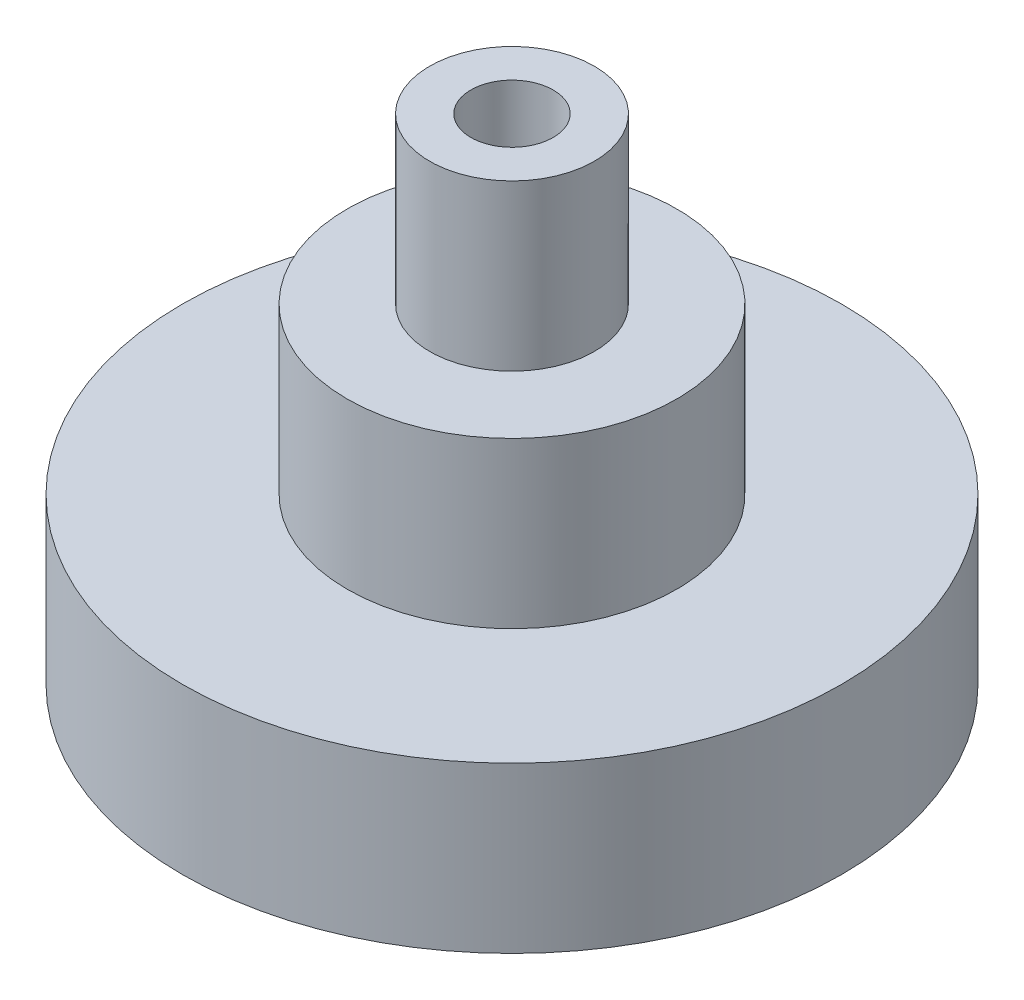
from build123d import *

# Parameters (mm, degrees)
SKETCH1_R      = 6.35
SKETCH1_R_2    = 3.175
EXTRUDE1_DEPTH = 38.1
SKETCH1_4_R    = 12.7
SKETCH1_4_R_2  = 6.35
EXTRUDE2_DEPTH = 25.4
SKETCH1_5_R    = 25.4
SKETCH1_5_R_2  = 12.7
EXTRUDE3_DEPTH = 12.7


with BuildPart() as part:
    # Sketch1 → Extrude1 (new body)
    with BuildSketch(Plane(origin=(0, 0, 0), x_dir=(1, 0, 0), z_dir=(0, 1, 0))):
        with Locations(Location((-40.004508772, 10.294319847, 0), (0, 0, 90))):
            Circle(SKETCH1_R)
        with Locations(Location((-40.004508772, 10.294319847, 0), (0, 0, 90))):
            Circle(SKETCH1_R_2, mode=Mode.SUBTRACT)
    extrude(amount=EXTRUDE1_DEPTH)

    # Sketch1_4 → Extrude2 (add)
    with BuildSketch(Plane(origin=(0, 0, 0), x_dir=(1, 0, 0), z_dir=(0, 1, 0))):
        with Locations(Location((-40.004508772, 10.294319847, 0), (0, 0, 270))):
            Circle(SKETCH1_4_R)
        with Locations(Location((-40.004508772, 10.294319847, 0), (0, 0, 90))):
            Circle(SKETCH1_4_R_2, mode=Mode.SUBTRACT)
    extrude(amount=EXTRUDE2_DEPTH)

    # Sketch1_5 → Extrude3 (add)
    with BuildSketch(Plane(origin=(0, 0, 0), x_dir=(1, 0, 0), z_dir=(0, 1, 0))):
        with Locations(Location((-40.004508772, 10.294319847, 0), (0, 0, 270))):
            Circle(SKETCH1_5_R)
        with Locations(Location((-40.004508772, 10.294319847, 0), (0, 0, 270))):
            Circle(SKETCH1_5_R_2, mode=Mode.SUBTRACT)
    extrude(amount=EXTRUDE3_DEPTH)


solid = part.part
